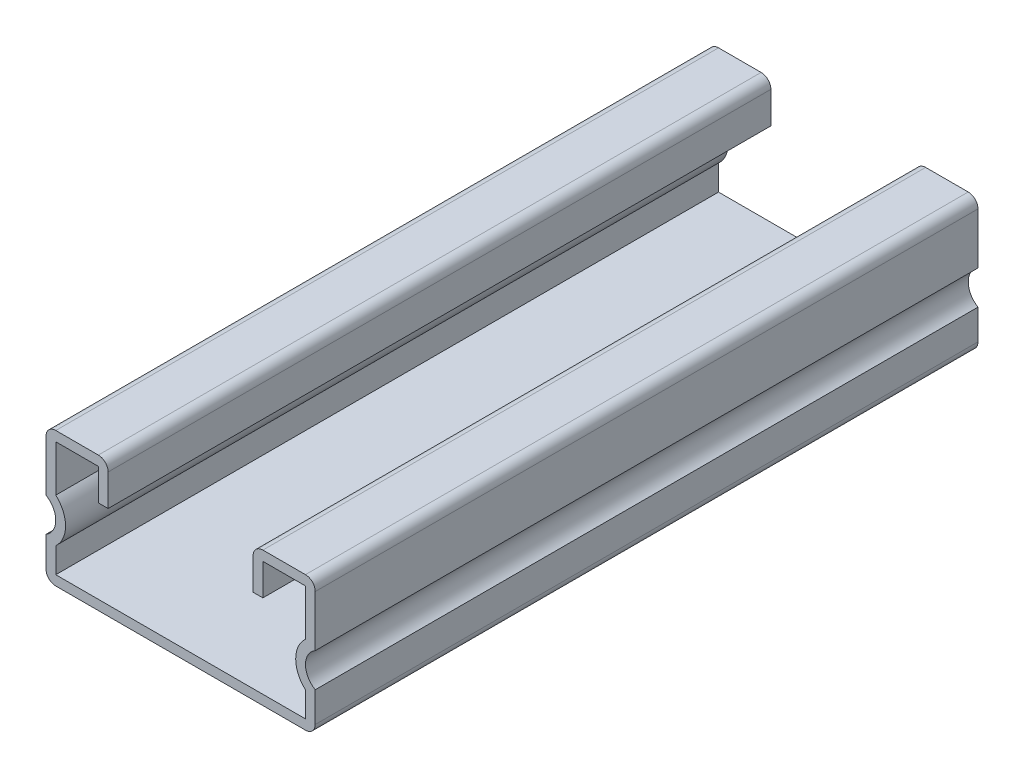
ISO-10303-21;
HEADER;
FILE_DESCRIPTION(('STEP AP214'),'2;1');
FILE_NAME('part.step','',(''),(''),'','','');
FILE_SCHEMA(('AUTOMOTIVE_DESIGN { 1 0 10303 214 1 1 1 1 }'));
ENDSEC;
DATA;
#1=APPLICATION_CONTEXT('core data for automotive mechanical design processes');
#2=APPLICATION_PROTOCOL_DEFINITION('international standard','automotive_design',2000,#1);
#3=PRODUCT_CONTEXT('',#1,'mechanical');
#4=PRODUCT('Part','Part','',(#3));
#5=PRODUCT_RELATED_PRODUCT_CATEGORY('part','',(#4));
#6=PRODUCT_DEFINITION_FORMATION('','',#4);
#7=PRODUCT_DEFINITION_CONTEXT('part definition',#1,'design');
#8=PRODUCT_DEFINITION('design','',#6,#7);
#9=PRODUCT_DEFINITION_SHAPE('','',#8);
#10=(LENGTH_UNIT() NAMED_UNIT(*) SI_UNIT(.MILLI.,.METRE.));
#11=(NAMED_UNIT(*) PLANE_ANGLE_UNIT() SI_UNIT($,.RADIAN.));
#12=(NAMED_UNIT(*) SI_UNIT($,.STERADIAN.) SOLID_ANGLE_UNIT());
#13=UNCERTAINTY_MEASURE_WITH_UNIT(LENGTH_MEASURE(1.E-05),#10,'distance_accuracy_value','');
#14=(GEOMETRIC_REPRESENTATION_CONTEXT(3) GLOBAL_UNCERTAINTY_ASSIGNED_CONTEXT((#13)) GLOBAL_UNIT_ASSIGNED_CONTEXT((#10,
#11,#12)) REPRESENTATION_CONTEXT('',''));
#15=CARTESIAN_POINT('',(0.,0.,0.));
#16=DIRECTION('',(0.,0.,1.));
#17=DIRECTION('',(1.,0.,0.));
#18=AXIS2_PLACEMENT_3D('',#15,#16,#17);
#19=CARTESIAN_POINT('',(-19.1389,10.4394,101.6));
#20=DIRECTION('',(-1.,0.,0.));
#21=DIRECTION('',(0.,0.,1.));
#22=AXIS2_PLACEMENT_3D('',#19,#20,#21);
#23=PLANE('',#22);
#24=DIRECTION('',(0.,1.,0.));
#25=VECTOR('',#24,1.);
#26=CARTESIAN_POINT('',(-19.1389,10.4394,0.));
#27=LINE('',#26,#25);
#28=CARTESIAN_POINT('',(-19.1389,3.35097147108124,0.));
#29=VERTEX_POINT('',#28);
#30=CARTESIAN_POINT('',(-19.1389,10.4394,0.));
#31=VERTEX_POINT('',#30);
#32=EDGE_CURVE('E261',#29,#31,#27,.T.);
#33=ORIENTED_EDGE('',*,*,#32,.T.);
#34=DIRECTION('',(0.,0.,-1.));
#35=VECTOR('',#34,1.);
#36=CARTESIAN_POINT('',(-19.1389,10.4394,101.6));
#37=LINE('',#36,#35);
#38=CARTESIAN_POINT('',(-19.1389,10.4394,101.6));
#39=VERTEX_POINT('',#38);
#40=EDGE_CURVE('E11',#39,#31,#37,.T.);
#41=ORIENTED_EDGE('',*,*,#40,.F.);
#42=DIRECTION('',(0.,1.,0.));
#43=VECTOR('',#42,1.);
#44=CARTESIAN_POINT('',(-19.1389,10.4394,101.6));
#45=LINE('',#44,#43);
#46=CARTESIAN_POINT('',(-19.1389,3.35097147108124,101.6));
#47=VERTEX_POINT('',#46);
#48=EDGE_CURVE('E319',#47,#39,#45,.T.);
#49=ORIENTED_EDGE('',*,*,#48,.F.);
#50=DIRECTION('',(0.,0.,-1.));
#51=VECTOR('',#50,1.);
#52=CARTESIAN_POINT('',(-19.1389,3.35097147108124,101.6));
#53=LINE('',#52,#51);
#54=EDGE_CURVE('E257',#47,#29,#53,.T.);
#55=ORIENTED_EDGE('',*,*,#54,.T.);
#56=EDGE_LOOP('',(#33,#41,#49,#55));
#57=FACE_BOUND('',#56,.T.);
#58=ADVANCED_FACE('F32',(#57),#23,.F.);
#59=CARTESIAN_POINT('',(-19.1389,10.4394,101.6));
#60=DIRECTION('',(0.,1.,0.));
#61=DIRECTION('',(-1.,0.,0.));
#62=AXIS2_PLACEMENT_3D('',#59,#60,#61);
#63=PLANE('',#62);
#64=DIRECTION('',(1.,0.,0.));
#65=VECTOR('',#64,1.);
#66=CARTESIAN_POINT('',(-19.1389,10.4394,0.));
#67=LINE('',#66,#65);
#68=CARTESIAN_POINT('',(-12.6111,10.4394,0.));
#69=VERTEX_POINT('',#68);
#70=EDGE_CURVE('E264',#31,#69,#67,.T.);
#71=ORIENTED_EDGE('',*,*,#70,.T.);
#72=DIRECTION('',(0.,0.,-1.));
#73=VECTOR('',#72,1.);
#74=CARTESIAN_POINT('',(-12.6111,10.4394,101.6));
#75=LINE('',#74,#73);
#76=CARTESIAN_POINT('',(-12.6111,10.4394,101.6));
#77=VERTEX_POINT('',#76);
#78=EDGE_CURVE('E41',#77,#69,#75,.T.);
#79=ORIENTED_EDGE('',*,*,#78,.F.);
#80=DIRECTION('',(1.,0.,0.));
#81=VECTOR('',#80,1.);
#82=CARTESIAN_POINT('',(-19.1389,10.4394,101.6));
#83=LINE('',#82,#81);
#84=EDGE_CURVE('E158',#39,#77,#83,.T.);
#85=ORIENTED_EDGE('',*,*,#84,.F.);
#86=ORIENTED_EDGE('',*,*,#40,.T.);
#87=EDGE_LOOP('',(#71,#79,#85,#86));
#88=FACE_BOUND('',#87,.T.);
#89=ADVANCED_FACE('F488',(#88),#63,.F.);
#90=CARTESIAN_POINT('',(-12.6111,10.4394,101.6));
#91=DIRECTION('',(1.,0.,0.));
#92=DIRECTION('',(0.,0.,-1.));
#93=AXIS2_PLACEMENT_3D('',#90,#91,#92);
#94=PLANE('',#93);
#95=DIRECTION('',(0.,-1.,0.));
#96=VECTOR('',#95,1.);
#97=CARTESIAN_POINT('',(-12.6111,10.4394,0.));
#98=LINE('',#97,#96);
#99=CARTESIAN_POINT('',(-12.6111,5.588,0.));
#100=VERTEX_POINT('',#99);
#101=EDGE_CURVE('E266',#69,#100,#98,.T.);
#102=ORIENTED_EDGE('',*,*,#101,.T.);
#103=DIRECTION('',(0.,0.,-1.));
#104=VECTOR('',#103,1.);
#105=CARTESIAN_POINT('',(-12.6111,5.588,101.6));
#106=LINE('',#105,#104);
#107=CARTESIAN_POINT('',(-12.6111,5.588,101.6));
#108=VERTEX_POINT('',#107);
#109=EDGE_CURVE('E392',#108,#100,#106,.T.);
#110=ORIENTED_EDGE('',*,*,#109,.F.);
#111=DIRECTION('',(0.,-1.,0.));
#112=VECTOR('',#111,1.);
#113=CARTESIAN_POINT('',(-12.6111,10.4394,101.6));
#114=LINE('',#113,#112);
#115=EDGE_CURVE('E401',#77,#108,#114,.T.);
#116=ORIENTED_EDGE('',*,*,#115,.F.);
#117=ORIENTED_EDGE('',*,*,#78,.T.);
#118=EDGE_LOOP('',(#102,#110,#116,#117));
#119=FACE_BOUND('',#118,.T.);
#120=ADVANCED_FACE('F399',(#119),#94,.F.);
#121=CARTESIAN_POINT('',(-12.6111,5.588,101.6));
#122=DIRECTION('',(0.,1.,0.));
#123=DIRECTION('',(0.,0.,1.));
#124=AXIS2_PLACEMENT_3D('',#121,#122,#123);
#125=PLANE('',#124);
#126=DIRECTION('',(1.,0.,0.));
#127=VECTOR('',#126,1.);
#128=CARTESIAN_POINT('',(-12.6111,5.588,0.));
#129=LINE('',#128,#127);
#130=CARTESIAN_POINT('',(-11.1125,5.588,0.));
#131=VERTEX_POINT('',#130);
#132=EDGE_CURVE('E268',#100,#131,#129,.T.);
#133=ORIENTED_EDGE('',*,*,#132,.T.);
#134=DIRECTION('',(0.,0.,-1.));
#135=VECTOR('',#134,1.);
#136=CARTESIAN_POINT('',(-11.1125,5.588,101.6));
#137=LINE('',#136,#135);
#138=CARTESIAN_POINT('',(-11.1125,5.588,101.6));
#139=VERTEX_POINT('',#138);
#140=EDGE_CURVE('E389',#139,#131,#137,.T.);
#141=ORIENTED_EDGE('',*,*,#140,.F.);
#142=DIRECTION('',(1.,0.,0.));
#143=VECTOR('',#142,1.);
#144=CARTESIAN_POINT('',(-12.6111,5.588,101.6));
#145=LINE('',#144,#143);
#146=EDGE_CURVE('E419',#108,#139,#145,.T.);
#147=ORIENTED_EDGE('',*,*,#146,.F.);
#148=ORIENTED_EDGE('',*,*,#109,.T.);
#149=EDGE_LOOP('',(#133,#141,#147,#148));
#150=FACE_BOUND('',#149,.T.);
#151=ADVANCED_FACE('F410',(#150),#125,.F.);
#152=CARTESIAN_POINT('',(-11.1125,10.4394,101.6));
#153=DIRECTION('',(-1.,0.,0.));
#154=DIRECTION('',(0.,-1.,0.));
#155=AXIS2_PLACEMENT_3D('',#152,#153,#154);
#156=PLANE('',#155);
#157=DIRECTION('',(0.,1.,0.));
#158=VECTOR('',#157,1.);
#159=CARTESIAN_POINT('',(-11.1125,10.4394,0.));
#160=LINE('',#159,#158);
#161=CARTESIAN_POINT('',(-11.1125,10.4394,0.));
#162=VERTEX_POINT('',#161);
#163=EDGE_CURVE('E270',#131,#162,#160,.T.);
#164=ORIENTED_EDGE('',*,*,#163,.T.);
#165=DIRECTION('',(0.,0.,-1.));
#166=VECTOR('',#165,1.);
#167=CARTESIAN_POINT('',(-11.1125,10.4394,101.6));
#168=LINE('',#167,#166);
#169=CARTESIAN_POINT('',(-11.1125,10.4394,101.6));
#170=VERTEX_POINT('',#169);
#171=EDGE_CURVE('E386',#170,#162,#168,.T.);
#172=ORIENTED_EDGE('',*,*,#171,.F.);
#173=DIRECTION('',(0.,1.,0.));
#174=VECTOR('',#173,1.);
#175=CARTESIAN_POINT('',(-11.1125,10.4394,101.6));
#176=LINE('',#175,#174);
#177=EDGE_CURVE('E416',#139,#170,#176,.T.);
#178=ORIENTED_EDGE('',*,*,#177,.F.);
#179=ORIENTED_EDGE('',*,*,#140,.T.);
#180=EDGE_LOOP('',(#164,#172,#178,#179));
#181=FACE_BOUND('',#180,.T.);
#182=ADVANCED_FACE('F414',(#181),#156,.F.);
#183=CARTESIAN_POINT('',(-12.6111,10.4394,101.6));
#184=DIRECTION('',(0.,0.,-1.));
#185=DIRECTION('',(-1.,0.,0.));
#186=AXIS2_PLACEMENT_3D('',#183,#184,#185);
#187=CYLINDRICAL_SURFACE('',#186,1.4986);
#188=CARTESIAN_POINT('',(-12.6111,10.4394,0.));
#189=DIRECTION('',(0.,0.,1.));
#190=DIRECTION('',(-1.,0.,0.));
#191=AXIS2_PLACEMENT_3D('',#188,#189,#190);
#192=CIRCLE('',#191,1.4986);
#193=CARTESIAN_POINT('',(-12.6111,11.938,0.));
#194=VERTEX_POINT('',#193);
#195=EDGE_CURVE('E272',#162,#194,#192,.T.);
#196=ORIENTED_EDGE('',*,*,#195,.T.);
#197=DIRECTION('',(0.,0.,-1.));
#198=VECTOR('',#197,1.);
#199=CARTESIAN_POINT('',(-12.6111,11.938,101.6));
#200=LINE('',#199,#198);
#201=CARTESIAN_POINT('',(-12.6111,11.938,101.6));
#202=VERTEX_POINT('',#201);
#203=EDGE_CURVE('E383',#202,#194,#200,.T.);
#204=ORIENTED_EDGE('',*,*,#203,.F.);
#205=CARTESIAN_POINT('',(-12.6111,10.4394,101.6));
#206=DIRECTION('',(0.,0.,1.));
#207=DIRECTION('',(-1.,0.,0.));
#208=AXIS2_PLACEMENT_3D('',#205,#206,#207);
#209=CIRCLE('',#208,1.4986);
#210=EDGE_CURVE('E418',#170,#202,#209,.T.);
#211=ORIENTED_EDGE('',*,*,#210,.F.);
#212=ORIENTED_EDGE('',*,*,#171,.T.);
#213=EDGE_LOOP('',(#196,#204,#211,#212));
#214=FACE_BOUND('',#213,.T.);
#215=ADVANCED_FACE('F501',(#214),#187,.T.);
#216=CARTESIAN_POINT('',(-19.1389,11.938,101.6));
#217=DIRECTION('',(0.,-1.,0.));
#218=DIRECTION('',(0.,0.,-1.));
#219=AXIS2_PLACEMENT_3D('',#216,#217,#218);
#220=PLANE('',#219);
#221=DIRECTION('',(-1.,0.,0.));
#222=VECTOR('',#221,1.);
#223=CARTESIAN_POINT('',(-19.1389,11.938,0.));
#224=LINE('',#223,#222);
#225=CARTESIAN_POINT('',(-19.1389,11.938,0.));
#226=VERTEX_POINT('',#225);
#227=EDGE_CURVE('E274',#194,#226,#224,.T.);
#228=ORIENTED_EDGE('',*,*,#227,.T.);
#229=DIRECTION('',(0.,0.,-1.));
#230=VECTOR('',#229,1.);
#231=CARTESIAN_POINT('',(-19.1389,11.938,101.6));
#232=LINE('',#231,#230);
#233=CARTESIAN_POINT('',(-19.1389,11.938,101.6));
#234=VERTEX_POINT('',#233);
#235=EDGE_CURVE('E380',#234,#226,#232,.T.);
#236=ORIENTED_EDGE('',*,*,#235,.F.);
#237=DIRECTION('',(-1.,0.,0.));
#238=VECTOR('',#237,1.);
#239=CARTESIAN_POINT('',(-19.1389,11.938,101.6));
#240=LINE('',#239,#238);
#241=EDGE_CURVE('E421',#202,#234,#240,.T.);
#242=ORIENTED_EDGE('',*,*,#241,.F.);
#243=ORIENTED_EDGE('',*,*,#203,.T.);
#244=EDGE_LOOP('',(#228,#236,#242,#243));
#245=FACE_BOUND('',#244,.T.);
#246=ADVANCED_FACE('F504',(#245),#220,.F.);
#247=CARTESIAN_POINT('',(-19.1389,10.4394,101.6));
#248=DIRECTION('',(0.,0.,-1.));
#249=DIRECTION('',(-1.,0.,0.));
#250=AXIS2_PLACEMENT_3D('',#247,#248,#249);
#251=CYLINDRICAL_SURFACE('',#250,1.49860000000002);
#252=CARTESIAN_POINT('',(-19.1389,10.4394,0.));
#253=DIRECTION('',(0.,0.,1.));
#254=DIRECTION('',(-1.,0.,0.));
#255=AXIS2_PLACEMENT_3D('',#252,#253,#254);
#256=CIRCLE('',#255,1.49860000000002);
#257=CARTESIAN_POINT('',(-20.6375,10.4394,0.));
#258=VERTEX_POINT('',#257);
#259=EDGE_CURVE('E276',#226,#258,#256,.T.);
#260=ORIENTED_EDGE('',*,*,#259,.T.);
#261=DIRECTION('',(0.,0.,-1.));
#262=VECTOR('',#261,1.);
#263=CARTESIAN_POINT('',(-20.6375,10.4394,101.6));
#264=LINE('',#263,#262);
#265=CARTESIAN_POINT('',(-20.6375,10.4394,101.6));
#266=VERTEX_POINT('',#265);
#267=EDGE_CURVE('E377',#266,#258,#264,.T.);
#268=ORIENTED_EDGE('',*,*,#267,.F.);
#269=CARTESIAN_POINT('',(-19.1389,10.4394,101.6));
#270=DIRECTION('',(0.,0.,1.));
#271=DIRECTION('',(-1.,0.,0.));
#272=AXIS2_PLACEMENT_3D('',#269,#270,#271);
#273=CIRCLE('',#272,1.49860000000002);
#274=EDGE_CURVE('E427',#234,#266,#273,.T.);
#275=ORIENTED_EDGE('',*,*,#274,.F.);
#276=ORIENTED_EDGE('',*,*,#235,.T.);
#277=EDGE_LOOP('',(#260,#268,#275,#276));
#278=FACE_BOUND('',#277,.T.);
#279=ADVANCED_FACE('F508',(#278),#251,.T.);
#280=CARTESIAN_POINT('',(-20.6375,10.4394,101.6));
#281=DIRECTION('',(1.,0.,0.));
#282=DIRECTION('',(0.,1.,0.));
#283=AXIS2_PLACEMENT_3D('',#280,#281,#282);
#284=PLANE('',#283);
#285=DIRECTION('',(0.,-1.,0.));
#286=VECTOR('',#285,1.);
#287=CARTESIAN_POINT('',(-20.6375,10.4394,0.));
#288=LINE('',#287,#286);
#289=CARTESIAN_POINT('',(-20.6375,2.59565134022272,0.));
#290=VERTEX_POINT('',#289);
#291=EDGE_CURVE('E278',#258,#290,#288,.T.);
#292=ORIENTED_EDGE('',*,*,#291,.T.);
#293=DIRECTION('',(0.,0.,-1.));
#294=VECTOR('',#293,1.);
#295=CARTESIAN_POINT('',(-20.6375,2.59565134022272,101.6));
#296=LINE('',#295,#294);
#297=CARTESIAN_POINT('',(-20.6375,2.59565134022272,101.6));
#298=VERTEX_POINT('',#297);
#299=EDGE_CURVE('E374',#298,#290,#296,.T.);
#300=ORIENTED_EDGE('',*,*,#299,.F.);
#301=DIRECTION('',(0.,-1.,0.));
#302=VECTOR('',#301,1.);
#303=CARTESIAN_POINT('',(-20.6375,10.4394,101.6));
#304=LINE('',#303,#302);
#305=EDGE_CURVE('E429',#266,#298,#304,.T.);
#306=ORIENTED_EDGE('',*,*,#305,.F.);
#307=ORIENTED_EDGE('',*,*,#267,.T.);
#308=EDGE_LOOP('',(#292,#300,#306,#307));
#309=FACE_BOUND('',#308,.T.);
#310=ADVANCED_FACE('F512',(#309),#284,.F.);
#311=CARTESIAN_POINT('',(-22.1361,0.,101.6));
#312=DIRECTION('',(0.,0.,-1.));
#313=DIRECTION('',(-1.,0.,0.));
#314=AXIS2_PLACEMENT_3D('',#311,#312,#313);
#315=CYLINDRICAL_SURFACE('',#314,2.9972);
#316=CARTESIAN_POINT('',(-22.1361,0.,0.));
#317=DIRECTION('',(0.,0.,-1.));
#318=DIRECTION('',(1.,0.,0.));
#319=AXIS2_PLACEMENT_3D('',#316,#317,#318);
#320=CIRCLE('',#319,2.9972);
#321=CARTESIAN_POINT('',(-20.6375,-2.59565134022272,0.));
#322=VERTEX_POINT('',#321);
#323=EDGE_CURVE('E280',#290,#322,#320,.T.);
#324=ORIENTED_EDGE('',*,*,#323,.T.);
#325=DIRECTION('',(0.,0.,-1.));
#326=VECTOR('',#325,1.);
#327=CARTESIAN_POINT('',(-20.6375,-2.59565134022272,101.6));
#328=LINE('',#327,#326);
#329=CARTESIAN_POINT('',(-20.6375,-2.59565134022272,101.6));
#330=VERTEX_POINT('',#329);
#331=EDGE_CURVE('E371',#330,#322,#328,.T.);
#332=ORIENTED_EDGE('',*,*,#331,.F.);
#333=CARTESIAN_POINT('',(-22.1361,0.,101.6));
#334=DIRECTION('',(0.,0.,-1.));
#335=DIRECTION('',(1.,0.,0.));
#336=AXIS2_PLACEMENT_3D('',#333,#334,#335);
#337=CIRCLE('',#336,2.9972);
#338=EDGE_CURVE('E431',#298,#330,#337,.T.);
#339=ORIENTED_EDGE('',*,*,#338,.F.);
#340=ORIENTED_EDGE('',*,*,#299,.T.);
#341=EDGE_LOOP('',(#324,#332,#339,#340));
#342=FACE_BOUND('',#341,.T.);
#343=ADVANCED_FACE('F516',(#342),#315,.F.);
#344=CARTESIAN_POINT('',(-20.6375,-2.59565134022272,101.6));
#345=DIRECTION('',(1.,0.,0.));
#346=DIRECTION('',(0.,1.,0.));
#347=AXIS2_PLACEMENT_3D('',#344,#345,#346);
#348=PLANE('',#347);
#349=DIRECTION('',(0.,-1.,0.));
#350=VECTOR('',#349,1.);
#351=CARTESIAN_POINT('',(-20.6375,-2.59565134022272,0.));
#352=LINE('',#351,#350);
#353=CARTESIAN_POINT('',(-20.6375,-7.2136,0.));
#354=VERTEX_POINT('',#353);
#355=EDGE_CURVE('E282',#322,#354,#352,.T.);
#356=ORIENTED_EDGE('',*,*,#355,.T.);
#357=DIRECTION('',(0.,0.,-1.));
#358=VECTOR('',#357,1.);
#359=CARTESIAN_POINT('',(-20.6375,-7.2136,101.6));
#360=LINE('',#359,#358);
#361=CARTESIAN_POINT('',(-20.6375,-7.2136,101.6));
#362=VERTEX_POINT('',#361);
#363=EDGE_CURVE('E368',#362,#354,#360,.T.);
#364=ORIENTED_EDGE('',*,*,#363,.F.);
#365=DIRECTION('',(0.,-1.,0.));
#366=VECTOR('',#365,1.);
#367=CARTESIAN_POINT('',(-20.6375,-2.59565134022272,101.6));
#368=LINE('',#367,#366);
#369=EDGE_CURVE('E433',#330,#362,#368,.T.);
#370=ORIENTED_EDGE('',*,*,#369,.F.);
#371=ORIENTED_EDGE('',*,*,#331,.T.);
#372=EDGE_LOOP('',(#356,#364,#370,#371));
#373=FACE_BOUND('',#372,.T.);
#374=ADVANCED_FACE('F520',(#373),#348,.F.);
#375=CARTESIAN_POINT('',(-19.1389,-7.2136,101.6));
#376=DIRECTION('',(0.,0.,-1.));
#377=DIRECTION('',(-1.,0.,0.));
#378=AXIS2_PLACEMENT_3D('',#375,#376,#377);
#379=CYLINDRICAL_SURFACE('',#378,1.4986);
#380=CARTESIAN_POINT('',(-19.1389,-7.2136,0.));
#381=DIRECTION('',(0.,0.,1.));
#382=DIRECTION('',(-1.,0.,0.));
#383=AXIS2_PLACEMENT_3D('',#380,#381,#382);
#384=CIRCLE('',#383,1.4986);
#385=CARTESIAN_POINT('',(-19.1389,-8.7122,0.));
#386=VERTEX_POINT('',#385);
#387=EDGE_CURVE('E284',#354,#386,#384,.T.);
#388=ORIENTED_EDGE('',*,*,#387,.T.);
#389=DIRECTION('',(0.,0.,-1.));
#390=VECTOR('',#389,1.);
#391=CARTESIAN_POINT('',(-19.1389,-8.7122,101.6));
#392=LINE('',#391,#390);
#393=CARTESIAN_POINT('',(-19.1389,-8.7122,101.6));
#394=VERTEX_POINT('',#393);
#395=EDGE_CURVE('E365',#394,#386,#392,.T.);
#396=ORIENTED_EDGE('',*,*,#395,.F.);
#397=CARTESIAN_POINT('',(-19.1389,-7.2136,101.6));
#398=DIRECTION('',(0.,0.,1.));
#399=DIRECTION('',(-1.,0.,0.));
#400=AXIS2_PLACEMENT_3D('',#397,#398,#399);
#401=CIRCLE('',#400,1.4986);
#402=EDGE_CURVE('E435',#362,#394,#401,.T.);
#403=ORIENTED_EDGE('',*,*,#402,.F.);
#404=ORIENTED_EDGE('',*,*,#363,.T.);
#405=EDGE_LOOP('',(#388,#396,#403,#404));
#406=FACE_BOUND('',#405,.T.);
#407=ADVANCED_FACE('F524',(#406),#379,.T.);
#408=CARTESIAN_POINT('',(-19.1389,-8.7122,101.6));
#409=DIRECTION('',(0.,1.,0.));
#410=DIRECTION('',(0.,0.,1.));
#411=AXIS2_PLACEMENT_3D('',#408,#409,#410);
#412=PLANE('',#411);
#413=CARTESIAN_POINT('',(0.,-8.7122,71.4375));
#414=DIRECTION('',(0.,-1.,0.));
#415=DIRECTION('',(0.,0.,-1.));
#416=AXIS2_PLACEMENT_3D('',#413,#414,#415);
#417=CIRCLE('',#416,7.14375);
#418=CARTESIAN_POINT('',(0.,-8.7122,64.29375));
#419=VERTEX_POINT('',#418);
#420=EDGE_CURVE('E601',#419,#419,#417,.T.);
#421=ORIENTED_EDGE('',*,*,#420,.F.);
#422=EDGE_LOOP('',(#421));
#423=FACE_BOUND('',#422,.T.);
#424=CARTESIAN_POINT('',(0.,-8.7122,23.8125));
#425=DIRECTION('',(0.,-1.,0.));
#426=DIRECTION('',(0.,0.,-1.));
#427=AXIS2_PLACEMENT_3D('',#424,#425,#426);
#428=CIRCLE('',#427,7.14375);
#429=CARTESIAN_POINT('',(0.,-8.7122,16.66875));
#430=VERTEX_POINT('',#429);
#431=EDGE_CURVE('E596',#430,#430,#428,.T.);
#432=ORIENTED_EDGE('',*,*,#431,.F.);
#433=EDGE_LOOP('',(#432));
#434=FACE_BOUND('',#433,.T.);
#435=DIRECTION('',(1.,0.,0.));
#436=VECTOR('',#435,1.);
#437=CARTESIAN_POINT('',(-19.1389,-8.7122,0.));
#438=LINE('',#437,#436);
#439=CARTESIAN_POINT('',(19.1389,-8.7122,0.));
#440=VERTEX_POINT('',#439);
#441=EDGE_CURVE('E286',#386,#440,#438,.T.);
#442=ORIENTED_EDGE('',*,*,#441,.T.);
#443=DIRECTION('',(0.,0.,-1.));
#444=VECTOR('',#443,1.);
#445=CARTESIAN_POINT('',(19.1389,-8.7122,101.6));
#446=LINE('',#445,#444);
#447=CARTESIAN_POINT('',(19.1389,-8.7122,101.6));
#448=VERTEX_POINT('',#447);
#449=EDGE_CURVE('E362',#448,#440,#446,.T.);
#450=ORIENTED_EDGE('',*,*,#449,.F.);
#451=DIRECTION('',(1.,0.,0.));
#452=VECTOR('',#451,1.);
#453=CARTESIAN_POINT('',(-19.1389,-8.7122,101.6));
#454=LINE('',#453,#452);
#455=EDGE_CURVE('E437',#394,#448,#454,.T.);
#456=ORIENTED_EDGE('',*,*,#455,.F.);
#457=ORIENTED_EDGE('',*,*,#395,.T.);
#458=EDGE_LOOP('',(#442,#450,#456,#457));
#459=FACE_BOUND('',#458,.T.);
#460=ADVANCED_FACE('F528',(#423,#434,#459),#412,.F.);
#461=CARTESIAN_POINT('',(19.1389,-7.2136,101.6));
#462=DIRECTION('',(0.,0.,-1.));
#463=DIRECTION('',(-1.,0.,0.));
#464=AXIS2_PLACEMENT_3D('',#461,#462,#463);
#465=CYLINDRICAL_SURFACE('',#464,1.4986);
#466=CARTESIAN_POINT('',(19.1389,-7.2136,0.));
#467=DIRECTION('',(0.,0.,1.));
#468=DIRECTION('',(-1.,0.,0.));
#469=AXIS2_PLACEMENT_3D('',#466,#467,#468);
#470=CIRCLE('',#469,1.4986);
#471=CARTESIAN_POINT('',(20.6375,-7.2136,0.));
#472=VERTEX_POINT('',#471);
#473=EDGE_CURVE('E288',#440,#472,#470,.T.);
#474=ORIENTED_EDGE('',*,*,#473,.T.);
#475=DIRECTION('',(0.,0.,-1.));
#476=VECTOR('',#475,1.);
#477=CARTESIAN_POINT('',(20.6375,-7.2136,101.6));
#478=LINE('',#477,#476);
#479=CARTESIAN_POINT('',(20.6375,-7.2136,101.6));
#480=VERTEX_POINT('',#479);
#481=EDGE_CURVE('E359',#480,#472,#478,.T.);
#482=ORIENTED_EDGE('',*,*,#481,.F.);
#483=CARTESIAN_POINT('',(19.1389,-7.2136,101.6));
#484=DIRECTION('',(0.,0.,1.));
#485=DIRECTION('',(-1.,0.,0.));
#486=AXIS2_PLACEMENT_3D('',#483,#484,#485);
#487=CIRCLE('',#486,1.4986);
#488=EDGE_CURVE('E439',#448,#480,#487,.T.);
#489=ORIENTED_EDGE('',*,*,#488,.F.);
#490=ORIENTED_EDGE('',*,*,#449,.T.);
#491=EDGE_LOOP('',(#474,#482,#489,#490));
#492=FACE_BOUND('',#491,.T.);
#493=ADVANCED_FACE('F532',(#492),#465,.T.);
#494=CARTESIAN_POINT('',(20.6375,-7.2136,101.6));
#495=DIRECTION('',(-1.,0.,0.));
#496=DIRECTION('',(0.,0.,1.));
#497=AXIS2_PLACEMENT_3D('',#494,#495,#496);
#498=PLANE('',#497);
#499=DIRECTION('',(0.,1.,0.));
#500=VECTOR('',#499,1.);
#501=CARTESIAN_POINT('',(20.6375,-7.2136,0.));
#502=LINE('',#501,#500);
#503=CARTESIAN_POINT('',(20.6375,-2.59565134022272,0.));
#504=VERTEX_POINT('',#503);
#505=EDGE_CURVE('E290',#472,#504,#502,.T.);
#506=ORIENTED_EDGE('',*,*,#505,.T.);
#507=DIRECTION('',(0.,0.,-1.));
#508=VECTOR('',#507,1.);
#509=CARTESIAN_POINT('',(20.6375,-2.59565134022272,101.6));
#510=LINE('',#509,#508);
#511=CARTESIAN_POINT('',(20.6375,-2.59565134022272,101.6));
#512=VERTEX_POINT('',#511);
#513=EDGE_CURVE('E356',#512,#504,#510,.T.);
#514=ORIENTED_EDGE('',*,*,#513,.F.);
#515=DIRECTION('',(0.,1.,0.));
#516=VECTOR('',#515,1.);
#517=CARTESIAN_POINT('',(20.6375,-7.2136,101.6));
#518=LINE('',#517,#516);
#519=EDGE_CURVE('E441',#480,#512,#518,.T.);
#520=ORIENTED_EDGE('',*,*,#519,.F.);
#521=ORIENTED_EDGE('',*,*,#481,.T.);
#522=EDGE_LOOP('',(#506,#514,#520,#521));
#523=FACE_BOUND('',#522,.T.);
#524=ADVANCED_FACE('F536',(#523),#498,.F.);
#525=CARTESIAN_POINT('',(22.1361,0.,101.6));
#526=DIRECTION('',(0.,0.,-1.));
#527=DIRECTION('',(-1.,0.,0.));
#528=AXIS2_PLACEMENT_3D('',#525,#526,#527);
#529=CYLINDRICAL_SURFACE('',#528,2.9972);
#530=CARTESIAN_POINT('',(22.1361,0.,0.));
#531=DIRECTION('',(0.,0.,-1.));
#532=DIRECTION('',(1.,0.,0.));
#533=AXIS2_PLACEMENT_3D('',#530,#531,#532);
#534=CIRCLE('',#533,2.9972);
#535=CARTESIAN_POINT('',(20.6375,2.59565134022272,0.));
#536=VERTEX_POINT('',#535);
#537=EDGE_CURVE('E292',#504,#536,#534,.T.);
#538=ORIENTED_EDGE('',*,*,#537,.T.);
#539=DIRECTION('',(0.,0.,-1.));
#540=VECTOR('',#539,1.);
#541=CARTESIAN_POINT('',(20.6375,2.59565134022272,101.6));
#542=LINE('',#541,#540);
#543=CARTESIAN_POINT('',(20.6375,2.59565134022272,101.6));
#544=VERTEX_POINT('',#543);
#545=EDGE_CURVE('E353',#544,#536,#542,.T.);
#546=ORIENTED_EDGE('',*,*,#545,.F.);
#547=CARTESIAN_POINT('',(22.1361,0.,101.6));
#548=DIRECTION('',(0.,0.,-1.));
#549=DIRECTION('',(1.,0.,0.));
#550=AXIS2_PLACEMENT_3D('',#547,#548,#549);
#551=CIRCLE('',#550,2.9972);
#552=EDGE_CURVE('E443',#512,#544,#551,.T.);
#553=ORIENTED_EDGE('',*,*,#552,.F.);
#554=ORIENTED_EDGE('',*,*,#513,.T.);
#555=EDGE_LOOP('',(#538,#546,#553,#554));
#556=FACE_BOUND('',#555,.T.);
#557=ADVANCED_FACE('F540',(#556),#529,.F.);
#558=CARTESIAN_POINT('',(20.6375,2.59565134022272,101.6));
#559=DIRECTION('',(-1.,0.,0.));
#560=DIRECTION('',(0.,-1.,0.));
#561=AXIS2_PLACEMENT_3D('',#558,#559,#560);
#562=PLANE('',#561);
#563=DIRECTION('',(0.,1.,0.));
#564=VECTOR('',#563,1.);
#565=CARTESIAN_POINT('',(20.6375,2.59565134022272,0.));
#566=LINE('',#565,#564);
#567=CARTESIAN_POINT('',(20.6375,10.4394,0.));
#568=VERTEX_POINT('',#567);
#569=EDGE_CURVE('E294',#536,#568,#566,.T.);
#570=ORIENTED_EDGE('',*,*,#569,.T.);
#571=DIRECTION('',(0.,0.,-1.));
#572=VECTOR('',#571,1.);
#573=CARTESIAN_POINT('',(20.6375,10.4394,101.6));
#574=LINE('',#573,#572);
#575=CARTESIAN_POINT('',(20.6375,10.4394,101.6));
#576=VERTEX_POINT('',#575);
#577=EDGE_CURVE('E350',#576,#568,#574,.T.);
#578=ORIENTED_EDGE('',*,*,#577,.F.);
#579=DIRECTION('',(0.,1.,0.));
#580=VECTOR('',#579,1.);
#581=CARTESIAN_POINT('',(20.6375,2.59565134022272,101.6));
#582=LINE('',#581,#580);
#583=EDGE_CURVE('E445',#544,#576,#582,.T.);
#584=ORIENTED_EDGE('',*,*,#583,.F.);
#585=ORIENTED_EDGE('',*,*,#545,.T.);
#586=EDGE_LOOP('',(#570,#578,#584,#585));
#587=FACE_BOUND('',#586,.T.);
#588=ADVANCED_FACE('F544',(#587),#562,.F.);
#589=CARTESIAN_POINT('',(19.1389,10.4394,101.6));
#590=DIRECTION('',(0.,0.,-1.));
#591=DIRECTION('',(-1.,0.,0.));
#592=AXIS2_PLACEMENT_3D('',#589,#590,#591);
#593=CYLINDRICAL_SURFACE('',#592,1.4986);
#594=CARTESIAN_POINT('',(19.1389,10.4394,0.));
#595=DIRECTION('',(0.,0.,1.));
#596=DIRECTION('',(-1.,0.,0.));
#597=AXIS2_PLACEMENT_3D('',#594,#595,#596);
#598=CIRCLE('',#597,1.4986);
#599=CARTESIAN_POINT('',(19.1389,11.938,0.));
#600=VERTEX_POINT('',#599);
#601=EDGE_CURVE('E296',#568,#600,#598,.T.);
#602=ORIENTED_EDGE('',*,*,#601,.T.);
#603=DIRECTION('',(0.,0.,-1.));
#604=VECTOR('',#603,1.);
#605=CARTESIAN_POINT('',(19.1389,11.938,101.6));
#606=LINE('',#605,#604);
#607=CARTESIAN_POINT('',(19.1389,11.938,101.6));
#608=VERTEX_POINT('',#607);
#609=EDGE_CURVE('E347',#608,#600,#606,.T.);
#610=ORIENTED_EDGE('',*,*,#609,.F.);
#611=CARTESIAN_POINT('',(19.1389,10.4394,101.6));
#612=DIRECTION('',(0.,0.,1.));
#613=DIRECTION('',(-1.,0.,0.));
#614=AXIS2_PLACEMENT_3D('',#611,#612,#613);
#615=CIRCLE('',#614,1.4986);
#616=EDGE_CURVE('E447',#576,#608,#615,.T.);
#617=ORIENTED_EDGE('',*,*,#616,.F.);
#618=ORIENTED_EDGE('',*,*,#577,.T.);
#619=EDGE_LOOP('',(#602,#610,#617,#618));
#620=FACE_BOUND('',#619,.T.);
#621=ADVANCED_FACE('F548',(#620),#593,.T.);
#622=CARTESIAN_POINT('',(19.1389,11.938,101.6));
#623=DIRECTION('',(0.,-1.,0.));
#624=DIRECTION('',(1.,0.,0.));
#625=AXIS2_PLACEMENT_3D('',#622,#623,#624);
#626=PLANE('',#625);
#627=DIRECTION('',(-1.,0.,0.));
#628=VECTOR('',#627,1.);
#629=CARTESIAN_POINT('',(19.1389,11.938,0.));
#630=LINE('',#629,#628);
#631=CARTESIAN_POINT('',(12.6111,11.938,0.));
#632=VERTEX_POINT('',#631);
#633=EDGE_CURVE('E298',#600,#632,#630,.T.);
#634=ORIENTED_EDGE('',*,*,#633,.T.);
#635=DIRECTION('',(0.,0.,-1.));
#636=VECTOR('',#635,1.);
#637=CARTESIAN_POINT('',(12.6111,11.938,101.6));
#638=LINE('',#637,#636);
#639=CARTESIAN_POINT('',(12.6111,11.938,101.6));
#640=VERTEX_POINT('',#639);
#641=EDGE_CURVE('E344',#640,#632,#638,.T.);
#642=ORIENTED_EDGE('',*,*,#641,.F.);
#643=DIRECTION('',(-1.,0.,0.));
#644=VECTOR('',#643,1.);
#645=CARTESIAN_POINT('',(19.1389,11.938,101.6));
#646=LINE('',#645,#644);
#647=EDGE_CURVE('E449',#608,#640,#646,.T.);
#648=ORIENTED_EDGE('',*,*,#647,.F.);
#649=ORIENTED_EDGE('',*,*,#609,.T.);
#650=EDGE_LOOP('',(#634,#642,#648,#649));
#651=FACE_BOUND('',#650,.T.);
#652=ADVANCED_FACE('F552',(#651),#626,.F.);
#653=CARTESIAN_POINT('',(12.6111,10.4394,101.6));
#654=DIRECTION('',(0.,0.,-1.));
#655=DIRECTION('',(-1.,0.,0.));
#656=AXIS2_PLACEMENT_3D('',#653,#654,#655);
#657=CYLINDRICAL_SURFACE('',#656,1.4986);
#658=CARTESIAN_POINT('',(12.6111,10.4394,0.));
#659=DIRECTION('',(0.,0.,1.));
#660=DIRECTION('',(-1.,0.,0.));
#661=AXIS2_PLACEMENT_3D('',#658,#659,#660);
#662=CIRCLE('',#661,1.4986);
#663=CARTESIAN_POINT('',(11.1125,10.4394,0.));
#664=VERTEX_POINT('',#663);
#665=EDGE_CURVE('E300',#632,#664,#662,.T.);
#666=ORIENTED_EDGE('',*,*,#665,.T.);
#667=DIRECTION('',(0.,0.,-1.));
#668=VECTOR('',#667,1.);
#669=CARTESIAN_POINT('',(11.1125,10.4394,101.6));
#670=LINE('',#669,#668);
#671=CARTESIAN_POINT('',(11.1125,10.4394,101.6));
#672=VERTEX_POINT('',#671);
#673=EDGE_CURVE('E341',#672,#664,#670,.T.);
#674=ORIENTED_EDGE('',*,*,#673,.F.);
#675=CARTESIAN_POINT('',(12.6111,10.4394,101.6));
#676=DIRECTION('',(0.,0.,1.));
#677=DIRECTION('',(-1.,0.,0.));
#678=AXIS2_PLACEMENT_3D('',#675,#676,#677);
#679=CIRCLE('',#678,1.4986);
#680=EDGE_CURVE('E451',#640,#672,#679,.T.);
#681=ORIENTED_EDGE('',*,*,#680,.F.);
#682=ORIENTED_EDGE('',*,*,#641,.T.);
#683=EDGE_LOOP('',(#666,#674,#681,#682));
#684=FACE_BOUND('',#683,.T.);
#685=ADVANCED_FACE('F556',(#684),#657,.T.);
#686=CARTESIAN_POINT('',(11.1125,10.4394,101.6));
#687=DIRECTION('',(1.,0.,0.));
#688=DIRECTION('',(0.,0.,-1.));
#689=AXIS2_PLACEMENT_3D('',#686,#687,#688);
#690=PLANE('',#689);
#691=DIRECTION('',(0.,-1.,0.));
#692=VECTOR('',#691,1.);
#693=CARTESIAN_POINT('',(11.1125,10.4394,0.));
#694=LINE('',#693,#692);
#695=CARTESIAN_POINT('',(11.1125,5.588,0.));
#696=VERTEX_POINT('',#695);
#697=EDGE_CURVE('E302',#664,#696,#694,.T.);
#698=ORIENTED_EDGE('',*,*,#697,.T.);
#699=DIRECTION('',(0.,0.,-1.));
#700=VECTOR('',#699,1.);
#701=CARTESIAN_POINT('',(11.1125,5.588,101.6));
#702=LINE('',#701,#700);
#703=CARTESIAN_POINT('',(11.1125,5.588,101.6));
#704=VERTEX_POINT('',#703);
#705=EDGE_CURVE('E338',#704,#696,#702,.T.);
#706=ORIENTED_EDGE('',*,*,#705,.F.);
#707=DIRECTION('',(0.,-1.,0.));
#708=VECTOR('',#707,1.);
#709=CARTESIAN_POINT('',(11.1125,10.4394,101.6));
#710=LINE('',#709,#708);
#711=EDGE_CURVE('E453',#672,#704,#710,.T.);
#712=ORIENTED_EDGE('',*,*,#711,.F.);
#713=ORIENTED_EDGE('',*,*,#673,.T.);
#714=EDGE_LOOP('',(#698,#706,#712,#713));
#715=FACE_BOUND('',#714,.T.);
#716=ADVANCED_FACE('F560',(#715),#690,.F.);
#717=CARTESIAN_POINT('',(11.1125,5.588,101.6));
#718=DIRECTION('',(0.,1.,0.));
#719=DIRECTION('',(-1.,0.,0.));
#720=AXIS2_PLACEMENT_3D('',#717,#718,#719);
#721=PLANE('',#720);
#722=DIRECTION('',(1.,0.,0.));
#723=VECTOR('',#722,1.);
#724=CARTESIAN_POINT('',(11.1125,5.588,0.));
#725=LINE('',#724,#723);
#726=CARTESIAN_POINT('',(12.6111,5.588,0.));
#727=VERTEX_POINT('',#726);
#728=EDGE_CURVE('E304',#696,#727,#725,.T.);
#729=ORIENTED_EDGE('',*,*,#728,.T.);
#730=DIRECTION('',(0.,0.,-1.));
#731=VECTOR('',#730,1.);
#732=CARTESIAN_POINT('',(12.6111,5.588,101.6));
#733=LINE('',#732,#731);
#734=CARTESIAN_POINT('',(12.6111,5.588,101.6));
#735=VERTEX_POINT('',#734);
#736=EDGE_CURVE('E335',#735,#727,#733,.T.);
#737=ORIENTED_EDGE('',*,*,#736,.F.);
#738=DIRECTION('',(1.,0.,0.));
#739=VECTOR('',#738,1.);
#740=CARTESIAN_POINT('',(11.1125,5.588,101.6));
#741=LINE('',#740,#739);
#742=EDGE_CURVE('E455',#704,#735,#741,.T.);
#743=ORIENTED_EDGE('',*,*,#742,.F.);
#744=ORIENTED_EDGE('',*,*,#705,.T.);
#745=EDGE_LOOP('',(#729,#737,#743,#744));
#746=FACE_BOUND('',#745,.T.);
#747=ADVANCED_FACE('F564',(#746),#721,.F.);
#748=CARTESIAN_POINT('',(12.6111,10.4394,101.6));
#749=DIRECTION('',(-1.,0.,0.));
#750=DIRECTION('',(0.,0.,1.));
#751=AXIS2_PLACEMENT_3D('',#748,#749,#750);
#752=PLANE('',#751);
#753=DIRECTION('',(0.,1.,0.));
#754=VECTOR('',#753,1.);
#755=CARTESIAN_POINT('',(12.6111,10.4394,0.));
#756=LINE('',#755,#754);
#757=CARTESIAN_POINT('',(12.6111,10.4394,0.));
#758=VERTEX_POINT('',#757);
#759=EDGE_CURVE('E306',#727,#758,#756,.T.);
#760=ORIENTED_EDGE('',*,*,#759,.T.);
#761=DIRECTION('',(0.,0.,-1.));
#762=VECTOR('',#761,1.);
#763=CARTESIAN_POINT('',(12.6111,10.4394,101.6));
#764=LINE('',#763,#762);
#765=CARTESIAN_POINT('',(12.6111,10.4394,101.6));
#766=VERTEX_POINT('',#765);
#767=EDGE_CURVE('E332',#766,#758,#764,.T.);
#768=ORIENTED_EDGE('',*,*,#767,.F.);
#769=DIRECTION('',(0.,1.,0.));
#770=VECTOR('',#769,1.);
#771=CARTESIAN_POINT('',(12.6111,10.4394,101.6));
#772=LINE('',#771,#770);
#773=EDGE_CURVE('E457',#735,#766,#772,.T.);
#774=ORIENTED_EDGE('',*,*,#773,.F.);
#775=ORIENTED_EDGE('',*,*,#736,.T.);
#776=EDGE_LOOP('',(#760,#768,#774,#775));
#777=FACE_BOUND('',#776,.T.);
#778=ADVANCED_FACE('F568',(#777),#752,.F.);
#779=CARTESIAN_POINT('',(19.1389,10.4394,101.6));
#780=DIRECTION('',(0.,1.,0.));
#781=DIRECTION('',(-1.,0.,0.));
#782=AXIS2_PLACEMENT_3D('',#779,#780,#781);
#783=PLANE('',#782);
#784=DIRECTION('',(1.,0.,0.));
#785=VECTOR('',#784,1.);
#786=CARTESIAN_POINT('',(19.1389,10.4394,0.));
#787=LINE('',#786,#785);
#788=CARTESIAN_POINT('',(19.1389,10.4394,0.));
#789=VERTEX_POINT('',#788);
#790=EDGE_CURVE('E308',#758,#789,#787,.T.);
#791=ORIENTED_EDGE('',*,*,#790,.T.);
#792=DIRECTION('',(0.,0.,-1.));
#793=VECTOR('',#792,1.);
#794=CARTESIAN_POINT('',(19.1389,10.4394,101.6));
#795=LINE('',#794,#793);
#796=CARTESIAN_POINT('',(19.1389,10.4394,101.6));
#797=VERTEX_POINT('',#796);
#798=EDGE_CURVE('E329',#797,#789,#795,.T.);
#799=ORIENTED_EDGE('',*,*,#798,.F.);
#800=DIRECTION('',(1.,0.,0.));
#801=VECTOR('',#800,1.);
#802=CARTESIAN_POINT('',(19.1389,10.4394,101.6));
#803=LINE('',#802,#801);
#804=EDGE_CURVE('E459',#766,#797,#803,.T.);
#805=ORIENTED_EDGE('',*,*,#804,.F.);
#806=ORIENTED_EDGE('',*,*,#767,.T.);
#807=EDGE_LOOP('',(#791,#799,#805,#806));
#808=FACE_BOUND('',#807,.T.);
#809=ADVANCED_FACE('F572',(#808),#783,.F.);
#810=CARTESIAN_POINT('',(19.1389,3.35097147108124,101.6));
#811=DIRECTION('',(1.,0.,0.));
#812=DIRECTION('',(0.,1.,0.));
#813=AXIS2_PLACEMENT_3D('',#810,#811,#812);
#814=PLANE('',#813);
#815=DIRECTION('',(0.,-1.,0.));
#816=VECTOR('',#815,1.);
#817=CARTESIAN_POINT('',(19.1389,3.35097147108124,0.));
#818=LINE('',#817,#816);
#819=CARTESIAN_POINT('',(19.1389,3.35097147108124,0.));
#820=VERTEX_POINT('',#819);
#821=EDGE_CURVE('E310',#789,#820,#818,.T.);
#822=ORIENTED_EDGE('',*,*,#821,.T.);
#823=DIRECTION('',(0.,0.,-1.));
#824=VECTOR('',#823,1.);
#825=CARTESIAN_POINT('',(19.1389,3.35097147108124,101.6));
#826=LINE('',#825,#824);
#827=CARTESIAN_POINT('',(19.1389,3.35097147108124,101.6));
#828=VERTEX_POINT('',#827);
#829=EDGE_CURVE('E326',#828,#820,#826,.T.);
#830=ORIENTED_EDGE('',*,*,#829,.F.);
#831=DIRECTION('',(0.,-1.,0.));
#832=VECTOR('',#831,1.);
#833=CARTESIAN_POINT('',(19.1389,3.35097147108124,101.6));
#834=LINE('',#833,#832);
#835=EDGE_CURVE('E461',#797,#828,#834,.T.);
#836=ORIENTED_EDGE('',*,*,#835,.F.);
#837=ORIENTED_EDGE('',*,*,#798,.T.);
#838=EDGE_LOOP('',(#822,#830,#836,#837));
#839=FACE_BOUND('',#838,.T.);
#840=ADVANCED_FACE('F576',(#839),#814,.F.);
#841=CARTESIAN_POINT('',(22.1361,0.,101.6));
#842=DIRECTION('',(0.,0.,-1.));
#843=DIRECTION('',(-1.,0.,0.));
#844=AXIS2_PLACEMENT_3D('',#841,#842,#843);
#845=CYLINDRICAL_SURFACE('',#844,4.49580000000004);
#846=CARTESIAN_POINT('',(22.1361,0.,0.));
#847=DIRECTION('',(0.,0.,1.));
#848=DIRECTION('',(1.,0.,0.));
#849=AXIS2_PLACEMENT_3D('',#846,#847,#848);
#850=CIRCLE('',#849,4.49580000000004);
#851=CARTESIAN_POINT('',(19.1389,-3.35097147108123,0.));
#852=VERTEX_POINT('',#851);
#853=EDGE_CURVE('E312',#820,#852,#850,.T.);
#854=ORIENTED_EDGE('',*,*,#853,.T.);
#855=DIRECTION('',(0.,0.,-1.));
#856=VECTOR('',#855,1.);
#857=CARTESIAN_POINT('',(19.1389,-3.35097147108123,101.6));
#858=LINE('',#857,#856);
#859=CARTESIAN_POINT('',(19.1389,-3.35097147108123,101.6));
#860=VERTEX_POINT('',#859);
#861=EDGE_CURVE('E323',#860,#852,#858,.T.);
#862=ORIENTED_EDGE('',*,*,#861,.F.);
#863=CARTESIAN_POINT('',(22.1361,0.,101.6));
#864=DIRECTION('',(0.,0.,1.));
#865=DIRECTION('',(1.,0.,0.));
#866=AXIS2_PLACEMENT_3D('',#863,#864,#865);
#867=CIRCLE('',#866,4.49580000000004);
#868=EDGE_CURVE('E463',#828,#860,#867,.T.);
#869=ORIENTED_EDGE('',*,*,#868,.F.);
#870=ORIENTED_EDGE('',*,*,#829,.T.);
#871=EDGE_LOOP('',(#854,#862,#869,#870));
#872=FACE_BOUND('',#871,.T.);
#873=ADVANCED_FACE('F469',(#872),#845,.T.);
#874=CARTESIAN_POINT('',(19.1389,-7.2136,101.6));
#875=DIRECTION('',(1.,0.,0.));
#876=DIRECTION('',(0.,0.,-1.));
#877=AXIS2_PLACEMENT_3D('',#874,#875,#876);
#878=PLANE('',#877);
#879=DIRECTION('',(0.,-1.,0.));
#880=VECTOR('',#879,1.);
#881=CARTESIAN_POINT('',(19.1389,-7.2136,0.));
#882=LINE('',#881,#880);
#883=CARTESIAN_POINT('',(19.1389,-7.2136,0.));
#884=VERTEX_POINT('',#883);
#885=EDGE_CURVE('E314',#852,#884,#882,.T.);
#886=ORIENTED_EDGE('',*,*,#885,.T.);
#887=DIRECTION('',(0.,0.,-1.));
#888=VECTOR('',#887,1.);
#889=CARTESIAN_POINT('',(19.1389,-7.2136,101.6));
#890=LINE('',#889,#888);
#891=CARTESIAN_POINT('',(19.1389,-7.2136,101.6));
#892=VERTEX_POINT('',#891);
#893=EDGE_CURVE('E252',#892,#884,#890,.T.);
#894=ORIENTED_EDGE('',*,*,#893,.F.);
#895=DIRECTION('',(0.,-1.,0.));
#896=VECTOR('',#895,1.);
#897=CARTESIAN_POINT('',(19.1389,-7.2136,101.6));
#898=LINE('',#897,#896);
#899=EDGE_CURVE('E243',#860,#892,#898,.T.);
#900=ORIENTED_EDGE('',*,*,#899,.F.);
#901=ORIENTED_EDGE('',*,*,#861,.T.);
#902=EDGE_LOOP('',(#886,#894,#900,#901));
#903=FACE_BOUND('',#902,.T.);
#904=ADVANCED_FACE('F473',(#903),#878,.F.);
#905=CARTESIAN_POINT('',(-19.1389,-7.2136,101.6));
#906=DIRECTION('',(0.,-1.,0.));
#907=DIRECTION('',(0.,0.,-1.));
#908=AXIS2_PLACEMENT_3D('',#905,#906,#907);
#909=PLANE('',#908);
#910=CARTESIAN_POINT('',(0.,-7.2136,71.4375));
#911=DIRECTION('',(0.,-1.,0.));
#912=DIRECTION('',(0.,0.,-1.));
#913=AXIS2_PLACEMENT_3D('',#910,#911,#912);
#914=CIRCLE('',#913,7.14375);
#915=CARTESIAN_POINT('',(0.,-7.2136,64.29375));
#916=VERTEX_POINT('',#915);
#917=EDGE_CURVE('E592',#916,#916,#914,.T.);
#918=ORIENTED_EDGE('',*,*,#917,.T.);
#919=EDGE_LOOP('',(#918));
#920=FACE_BOUND('',#919,.T.);
#921=CARTESIAN_POINT('',(0.,-7.2136,23.8125));
#922=DIRECTION('',(0.,-1.,0.));
#923=DIRECTION('',(0.,0.,-1.));
#924=AXIS2_PLACEMENT_3D('',#921,#922,#923);
#925=CIRCLE('',#924,7.14375);
#926=CARTESIAN_POINT('',(0.,-7.2136,16.66875));
#927=VERTEX_POINT('',#926);
#928=EDGE_CURVE('E35',#927,#927,#925,.T.);
#929=ORIENTED_EDGE('',*,*,#928,.T.);
#930=EDGE_LOOP('',(#929));
#931=FACE_BOUND('',#930,.T.);
#932=DIRECTION('',(-1.,0.,0.));
#933=VECTOR('',#932,1.);
#934=CARTESIAN_POINT('',(-19.1389,-7.2136,0.));
#935=LINE('',#934,#933);
#936=CARTESIAN_POINT('',(-19.1389,-7.2136,0.));
#937=VERTEX_POINT('',#936);
#938=EDGE_CURVE('E251',#884,#937,#935,.T.);
#939=ORIENTED_EDGE('',*,*,#938,.T.);
#940=DIRECTION('',(0.,0.,-1.));
#941=VECTOR('',#940,1.);
#942=CARTESIAN_POINT('',(-19.1389,-7.2136,101.6));
#943=LINE('',#942,#941);
#944=CARTESIAN_POINT('',(-19.1389,-7.2136,101.6));
#945=VERTEX_POINT('',#944);
#946=EDGE_CURVE('E248',#945,#937,#943,.T.);
#947=ORIENTED_EDGE('',*,*,#946,.F.);
#948=DIRECTION('',(-1.,0.,0.));
#949=VECTOR('',#948,1.);
#950=CARTESIAN_POINT('',(-19.1389,-7.2136,101.6));
#951=LINE('',#950,#949);
#952=EDGE_CURVE('E237',#892,#945,#951,.T.);
#953=ORIENTED_EDGE('',*,*,#952,.F.);
#954=ORIENTED_EDGE('',*,*,#893,.T.);
#955=EDGE_LOOP('',(#939,#947,#953,#954));
#956=FACE_BOUND('',#955,.T.);
#957=ADVANCED_FACE('F249',(#920,#931,#956),#909,.F.);
#958=CARTESIAN_POINT('',(-19.1389,-3.35097147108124,101.6));
#959=DIRECTION('',(-1.,0.,0.));
#960=DIRECTION('',(0.,0.,1.));
#961=AXIS2_PLACEMENT_3D('',#958,#959,#960);
#962=PLANE('',#961);
#963=DIRECTION('',(0.,1.,0.));
#964=VECTOR('',#963,1.);
#965=CARTESIAN_POINT('',(-19.1389,-3.35097147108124,0.));
#966=LINE('',#965,#964);
#967=CARTESIAN_POINT('',(-19.1389,-3.35097147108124,0.));
#968=VERTEX_POINT('',#967);
#969=EDGE_CURVE('E144',#937,#968,#966,.T.);
#970=ORIENTED_EDGE('',*,*,#969,.T.);
#971=DIRECTION('',(0.,0.,-1.));
#972=VECTOR('',#971,1.);
#973=CARTESIAN_POINT('',(-19.1389,-3.35097147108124,101.6));
#974=LINE('',#973,#972);
#975=CARTESIAN_POINT('',(-19.1389,-3.35097147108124,101.6));
#976=VERTEX_POINT('',#975);
#977=EDGE_CURVE('E253',#976,#968,#974,.T.);
#978=ORIENTED_EDGE('',*,*,#977,.F.);
#979=DIRECTION('',(0.,1.,0.));
#980=VECTOR('',#979,1.);
#981=CARTESIAN_POINT('',(-19.1389,-3.35097147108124,101.6));
#982=LINE('',#981,#980);
#983=EDGE_CURVE('E241',#945,#976,#982,.T.);
#984=ORIENTED_EDGE('',*,*,#983,.F.);
#985=ORIENTED_EDGE('',*,*,#946,.T.);
#986=EDGE_LOOP('',(#970,#978,#984,#985));
#987=FACE_BOUND('',#986,.T.);
#988=ADVANCED_FACE('F255',(#987),#962,.F.);
#989=CARTESIAN_POINT('',(-22.1361,0.,101.6));
#990=DIRECTION('',(0.,0.,-1.));
#991=DIRECTION('',(-1.,0.,0.));
#992=AXIS2_PLACEMENT_3D('',#989,#990,#991);
#993=CYLINDRICAL_SURFACE('',#992,4.49580000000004);
#994=CARTESIAN_POINT('',(-22.1361,0.,0.));
#995=DIRECTION('',(0.,0.,1.));
#996=DIRECTION('',(1.,0.,0.));
#997=AXIS2_PLACEMENT_3D('',#994,#995,#996);
#998=CIRCLE('',#997,4.49580000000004);
#999=EDGE_CURVE('E150',#968,#29,#998,.T.);
#1000=ORIENTED_EDGE('',*,*,#999,.T.);
#1001=ORIENTED_EDGE('',*,*,#54,.F.);
#1002=CARTESIAN_POINT('',(-22.1361,0.,101.6));
#1003=DIRECTION('',(0.,0.,1.));
#1004=DIRECTION('',(1.,0.,0.));
#1005=AXIS2_PLACEMENT_3D('',#1002,#1003,#1004);
#1006=CIRCLE('',#1005,4.49580000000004);
#1007=EDGE_CURVE('E49',#976,#47,#1006,.T.);
#1008=ORIENTED_EDGE('',*,*,#1007,.F.);
#1009=ORIENTED_EDGE('',*,*,#977,.T.);
#1010=EDGE_LOOP('',(#1000,#1001,#1008,#1009));
#1011=FACE_BOUND('',#1010,.T.);
#1012=ADVANCED_FACE('F477',(#1011),#993,.T.);
#1013=CARTESIAN_POINT('',(-22.1361,0.,101.6));
#1014=DIRECTION('',(0.,0.,1.));
#1015=DIRECTION('',(1.,0.,0.));
#1016=AXIS2_PLACEMENT_3D('',#1013,#1014,#1015);
#1017=PLANE('',#1016);
#1018=ORIENTED_EDGE('',*,*,#48,.T.);
#1019=ORIENTED_EDGE('',*,*,#84,.T.);
#1020=ORIENTED_EDGE('',*,*,#115,.T.);
#1021=ORIENTED_EDGE('',*,*,#146,.T.);
#1022=ORIENTED_EDGE('',*,*,#177,.T.);
#1023=ORIENTED_EDGE('',*,*,#210,.T.);
#1024=ORIENTED_EDGE('',*,*,#241,.T.);
#1025=ORIENTED_EDGE('',*,*,#274,.T.);
#1026=ORIENTED_EDGE('',*,*,#305,.T.);
#1027=ORIENTED_EDGE('',*,*,#338,.T.);
#1028=ORIENTED_EDGE('',*,*,#369,.T.);
#1029=ORIENTED_EDGE('',*,*,#402,.T.);
#1030=ORIENTED_EDGE('',*,*,#455,.T.);
#1031=ORIENTED_EDGE('',*,*,#488,.T.);
#1032=ORIENTED_EDGE('',*,*,#519,.T.);
#1033=ORIENTED_EDGE('',*,*,#552,.T.);
#1034=ORIENTED_EDGE('',*,*,#583,.T.);
#1035=ORIENTED_EDGE('',*,*,#616,.T.);
#1036=ORIENTED_EDGE('',*,*,#647,.T.);
#1037=ORIENTED_EDGE('',*,*,#680,.T.);
#1038=ORIENTED_EDGE('',*,*,#711,.T.);
#1039=ORIENTED_EDGE('',*,*,#742,.T.);
#1040=ORIENTED_EDGE('',*,*,#773,.T.);
#1041=ORIENTED_EDGE('',*,*,#804,.T.);
#1042=ORIENTED_EDGE('',*,*,#835,.T.);
#1043=ORIENTED_EDGE('',*,*,#868,.T.);
#1044=ORIENTED_EDGE('',*,*,#899,.T.);
#1045=ORIENTED_EDGE('',*,*,#952,.T.);
#1046=ORIENTED_EDGE('',*,*,#983,.T.);
#1047=ORIENTED_EDGE('',*,*,#1007,.T.);
#1048=EDGE_LOOP('',(#1018,#1019,#1020,#1021,#1022,#1023,#1024,#1025,#1026,#1027,#1028,#1029,
#1030,#1031,#1032,#1033,#1034,#1035,#1036,#1037,#1038,#1039,#1040,#1041,#1042,#1043,#1044,#1045,
#1046,#1047));
#1049=FACE_BOUND('',#1048,.T.);
#1050=ADVANCED_FACE('F239',(#1049),#1017,.T.);
#1051=CARTESIAN_POINT('',(-22.1361,0.,0.));
#1052=DIRECTION('',(0.,0.,1.));
#1053=DIRECTION('',(1.,0.,0.));
#1054=AXIS2_PLACEMENT_3D('',#1051,#1052,#1053);
#1055=PLANE('',#1054);
#1056=ORIENTED_EDGE('',*,*,#32,.F.);
#1057=ORIENTED_EDGE('',*,*,#999,.F.);
#1058=ORIENTED_EDGE('',*,*,#969,.F.);
#1059=ORIENTED_EDGE('',*,*,#938,.F.);
#1060=ORIENTED_EDGE('',*,*,#885,.F.);
#1061=ORIENTED_EDGE('',*,*,#853,.F.);
#1062=ORIENTED_EDGE('',*,*,#821,.F.);
#1063=ORIENTED_EDGE('',*,*,#790,.F.);
#1064=ORIENTED_EDGE('',*,*,#759,.F.);
#1065=ORIENTED_EDGE('',*,*,#728,.F.);
#1066=ORIENTED_EDGE('',*,*,#697,.F.);
#1067=ORIENTED_EDGE('',*,*,#665,.F.);
#1068=ORIENTED_EDGE('',*,*,#633,.F.);
#1069=ORIENTED_EDGE('',*,*,#601,.F.);
#1070=ORIENTED_EDGE('',*,*,#569,.F.);
#1071=ORIENTED_EDGE('',*,*,#537,.F.);
#1072=ORIENTED_EDGE('',*,*,#505,.F.);
#1073=ORIENTED_EDGE('',*,*,#473,.F.);
#1074=ORIENTED_EDGE('',*,*,#441,.F.);
#1075=ORIENTED_EDGE('',*,*,#387,.F.);
#1076=ORIENTED_EDGE('',*,*,#355,.F.);
#1077=ORIENTED_EDGE('',*,*,#323,.F.);
#1078=ORIENTED_EDGE('',*,*,#291,.F.);
#1079=ORIENTED_EDGE('',*,*,#259,.F.);
#1080=ORIENTED_EDGE('',*,*,#227,.F.);
#1081=ORIENTED_EDGE('',*,*,#195,.F.);
#1082=ORIENTED_EDGE('',*,*,#163,.F.);
#1083=ORIENTED_EDGE('',*,*,#132,.F.);
#1084=ORIENTED_EDGE('',*,*,#101,.F.);
#1085=ORIENTED_EDGE('',*,*,#70,.F.);
#1086=EDGE_LOOP('',(#1056,#1057,#1058,#1059,#1060,#1061,#1062,#1063,#1064,#1065,#1066,#1067,
#1068,#1069,#1070,#1071,#1072,#1073,#1074,#1075,#1076,#1077,#1078,#1079,#1080,#1081,#1082,#1083,
#1084,#1085));
#1087=FACE_BOUND('',#1086,.T.);
#1088=ADVANCED_FACE('F405',(#1087),#1055,.F.);
#1089=CARTESIAN_POINT('',(0.,11.938,23.8125));
#1090=DIRECTION('',(0.,-1.,0.));
#1091=DIRECTION('',(0.,0.,-1.));
#1092=AXIS2_PLACEMENT_3D('',#1089,#1090,#1091);
#1093=CYLINDRICAL_SURFACE('',#1092,7.14375);
#1094=ORIENTED_EDGE('',*,*,#431,.T.);
#1095=EDGE_LOOP('',(#1094));
#1096=FACE_BOUND('',#1095,.T.);
#1097=ORIENTED_EDGE('',*,*,#928,.F.);
#1098=EDGE_LOOP('',(#1097));
#1099=FACE_BOUND('',#1098,.T.);
#1100=ADVANCED_FACE('F670',(#1096,#1099),#1093,.F.);
#1101=CARTESIAN_POINT('',(0.,11.938,71.4375));
#1102=DIRECTION('',(0.,-1.,0.));
#1103=DIRECTION('',(0.,0.,-1.));
#1104=AXIS2_PLACEMENT_3D('',#1101,#1102,#1103);
#1105=CYLINDRICAL_SURFACE('',#1104,7.14375);
#1106=ORIENTED_EDGE('',*,*,#420,.T.);
#1107=EDGE_LOOP('',(#1106));
#1108=FACE_BOUND('',#1107,.T.);
#1109=ORIENTED_EDGE('',*,*,#917,.F.);
#1110=EDGE_LOOP('',(#1109));
#1111=FACE_BOUND('',#1110,.T.);
#1112=ADVANCED_FACE('F609',(#1108,#1111),#1105,.F.);
#1113=CLOSED_SHELL('',(#58,#89,#120,#151,#182,#215,#246,#279,#310,#343,#374,#407,#460,#493,#524,
#557,#588,#621,#652,#685,#716,#747,#778,#809,#840,#873,#904,#957,#988,#1012,#1050,#1088,#1100,#1112));
#1114=MANIFOLD_SOLID_BREP('B2',#1113);
#1115=ADVANCED_BREP_SHAPE_REPRESENTATION('',(#18,#1114),#14);
#1116=SHAPE_DEFINITION_REPRESENTATION(#9,#1115);
ENDSEC;
END-ISO-10303-21;
